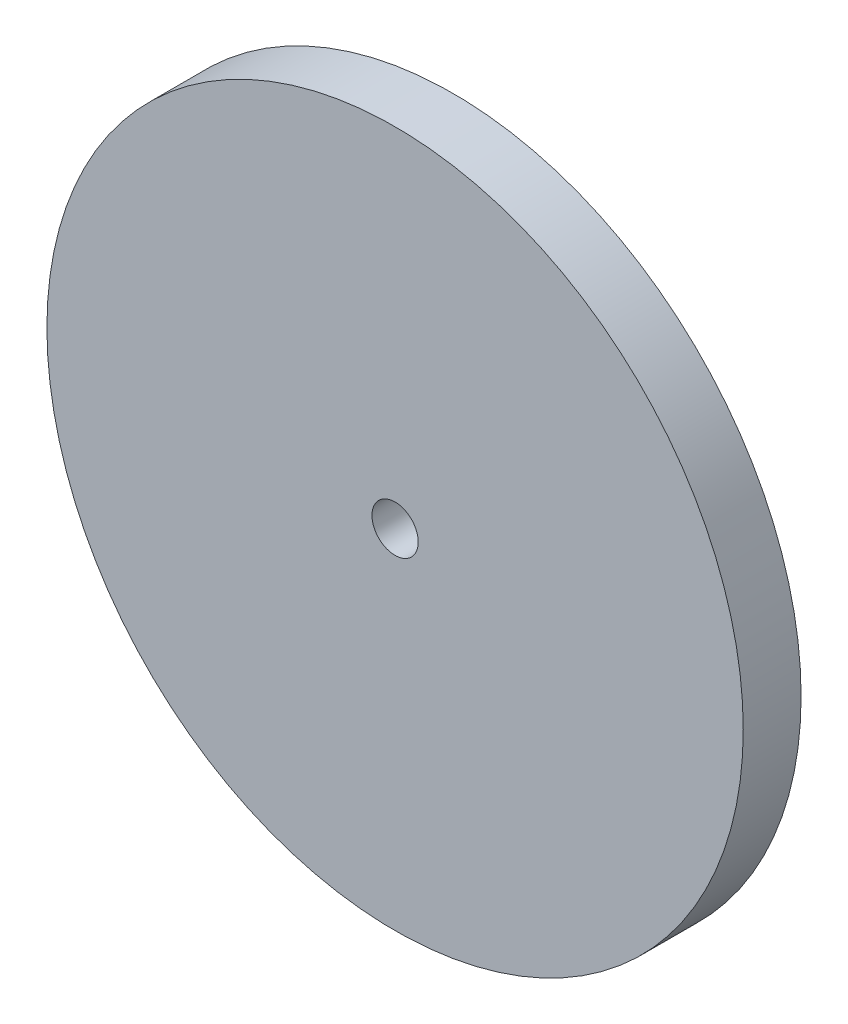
ISO-10303-21;
HEADER;
FILE_DESCRIPTION(('STEP AP214'),'2;1');
FILE_NAME('part.step','',(''),(''),'','','');
FILE_SCHEMA(('AUTOMOTIVE_DESIGN { 1 0 10303 214 1 1 1 1 }'));
ENDSEC;
DATA;
#1=APPLICATION_CONTEXT('core data for automotive mechanical design processes');
#2=APPLICATION_PROTOCOL_DEFINITION('international standard','automotive_design',2000,#1);
#3=PRODUCT_CONTEXT('',#1,'mechanical');
#4=PRODUCT('Part','Part','',(#3));
#5=PRODUCT_RELATED_PRODUCT_CATEGORY('part','',(#4));
#6=PRODUCT_DEFINITION_FORMATION('','',#4);
#7=PRODUCT_DEFINITION_CONTEXT('part definition',#1,'design');
#8=PRODUCT_DEFINITION('design','',#6,#7);
#9=PRODUCT_DEFINITION_SHAPE('','',#8);
#10=(LENGTH_UNIT() NAMED_UNIT(*) SI_UNIT(.MILLI.,.METRE.));
#11=(NAMED_UNIT(*) PLANE_ANGLE_UNIT() SI_UNIT($,.RADIAN.));
#12=(NAMED_UNIT(*) SI_UNIT($,.STERADIAN.) SOLID_ANGLE_UNIT());
#13=UNCERTAINTY_MEASURE_WITH_UNIT(LENGTH_MEASURE(1.E-05),#10,'distance_accuracy_value','');
#14=(GEOMETRIC_REPRESENTATION_CONTEXT(3) GLOBAL_UNCERTAINTY_ASSIGNED_CONTEXT((#13)) GLOBAL_UNIT_ASSIGNED_CONTEXT((#10,
#11,#12)) REPRESENTATION_CONTEXT('',''));
#15=CARTESIAN_POINT('',(0.,0.,0.));
#16=DIRECTION('',(0.,0.,1.));
#17=DIRECTION('',(1.,0.,0.));
#18=AXIS2_PLACEMENT_3D('',#15,#16,#17);
#19=CARTESIAN_POINT('',(0.,0.,10.));
#20=DIRECTION('',(0.,0.,1.));
#21=DIRECTION('',(1.,0.,0.));
#22=AXIS2_PLACEMENT_3D('',#19,#20,#21);
#23=PLANE('',#22);
#24=CARTESIAN_POINT('',(0.,0.,10.));
#25=DIRECTION('',(0.,0.,1.));
#26=DIRECTION('',(1.,0.,0.));
#27=AXIS2_PLACEMENT_3D('',#24,#25,#26);
#28=CIRCLE('',#27,60.2);
#29=CARTESIAN_POINT('',(60.2,0.,10.));
#30=VERTEX_POINT('',#29);
#31=EDGE_CURVE('E10',#30,#30,#28,.T.);
#32=ORIENTED_EDGE('',*,*,#31,.T.);
#33=EDGE_LOOP('',(#32));
#34=FACE_BOUND('',#33,.T.);
#35=CARTESIAN_POINT('',(0.,0.,10.));
#36=DIRECTION('',(0.,0.,1.));
#37=DIRECTION('',(1.,0.,0.));
#38=AXIS2_PLACEMENT_3D('',#35,#36,#37);
#39=CIRCLE('',#38,4.);
#40=CARTESIAN_POINT('',(4.,0.,10.));
#41=VERTEX_POINT('',#40);
#42=EDGE_CURVE('E45',#41,#41,#39,.T.);
#43=ORIENTED_EDGE('',*,*,#42,.F.);
#44=EDGE_LOOP('',(#43));
#45=FACE_BOUND('',#44,.T.);
#46=ADVANCED_FACE('F34',(#34,#45),#23,.T.);
#47=CARTESIAN_POINT('',(0.,0.,0.));
#48=DIRECTION('',(0.,0.,1.));
#49=DIRECTION('',(1.,0.,0.));
#50=AXIS2_PLACEMENT_3D('',#47,#48,#49);
#51=PLANE('',#50);
#52=CARTESIAN_POINT('',(0.,0.,0.));
#53=DIRECTION('',(0.,0.,1.));
#54=DIRECTION('',(1.,0.,0.));
#55=AXIS2_PLACEMENT_3D('',#52,#53,#54);
#56=CIRCLE('',#55,60.2);
#57=CARTESIAN_POINT('',(60.2,0.,0.));
#58=VERTEX_POINT('',#57);
#59=EDGE_CURVE('E38',#58,#58,#56,.T.);
#60=ORIENTED_EDGE('',*,*,#59,.F.);
#61=EDGE_LOOP('',(#60));
#62=FACE_BOUND('',#61,.T.);
#63=CARTESIAN_POINT('',(0.,0.,0.));
#64=DIRECTION('',(0.,0.,1.));
#65=DIRECTION('',(1.,0.,0.));
#66=AXIS2_PLACEMENT_3D('',#63,#64,#65);
#67=CIRCLE('',#66,4.);
#68=CARTESIAN_POINT('',(4.,0.,0.));
#69=VERTEX_POINT('',#68);
#70=EDGE_CURVE('E47',#69,#69,#67,.T.);
#71=ORIENTED_EDGE('',*,*,#70,.T.);
#72=EDGE_LOOP('',(#71));
#73=FACE_BOUND('',#72,.T.);
#74=ADVANCED_FACE('F57',(#62,#73),#51,.F.);
#75=CARTESIAN_POINT('',(0.,0.,10.));
#76=DIRECTION('',(0.,0.,-1.));
#77=DIRECTION('',(-1.,0.,0.));
#78=AXIS2_PLACEMENT_3D('',#75,#76,#77);
#79=CYLINDRICAL_SURFACE('',#78,60.2);
#80=ORIENTED_EDGE('',*,*,#31,.F.);
#81=EDGE_LOOP('',(#80));
#82=FACE_BOUND('',#81,.T.);
#83=ORIENTED_EDGE('',*,*,#59,.T.);
#84=EDGE_LOOP('',(#83));
#85=FACE_BOUND('',#84,.T.);
#86=ADVANCED_FACE('F36',(#82,#85),#79,.T.);
#87=CARTESIAN_POINT('',(0.,0.,10.));
#88=DIRECTION('',(0.,0.,-1.));
#89=DIRECTION('',(-1.,0.,0.));
#90=AXIS2_PLACEMENT_3D('',#87,#88,#89);
#91=CYLINDRICAL_SURFACE('',#90,4.);
#92=ORIENTED_EDGE('',*,*,#42,.T.);
#93=EDGE_LOOP('',(#92));
#94=FACE_BOUND('',#93,.T.);
#95=ORIENTED_EDGE('',*,*,#70,.F.);
#96=EDGE_LOOP('',(#95));
#97=FACE_BOUND('',#96,.T.);
#98=ADVANCED_FACE('F53',(#94,#97),#91,.F.);
#99=CLOSED_SHELL('',(#46,#74,#86,#98));
#100=MANIFOLD_SOLID_BREP('B2',#99);
#101=ADVANCED_BREP_SHAPE_REPRESENTATION('',(#18,#100),#14);
#102=SHAPE_DEFINITION_REPRESENTATION(#9,#101);
ENDSEC;
END-ISO-10303-21;
